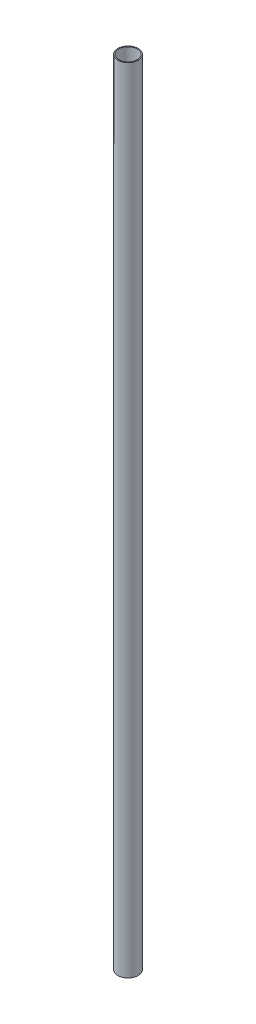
from build123d import *

# Parameters (mm, degrees)
SKIZZE3_4_R   = 11
SKIZZE3_4_R_2 = 10


with BuildPart() as part:
    # Austragung2: sweep along a path in Skizze4
    with BuildLine(Plane.XY) as austragung2_path:
        Line((0, 0), (0, 854.508754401))
    # Skizze3_4 → Austragung2 (sweep)
    with BuildSketch(Plane(origin=(0, 0, 0), x_dir=(1, 0, 0), z_dir=(0, 1, 0))):
        Circle(SKIZZE3_4_R)
        Circle(SKIZZE3_4_R_2, mode=Mode.SUBTRACT)
    sweep(path=austragung2_path.line)


solid = part.part
